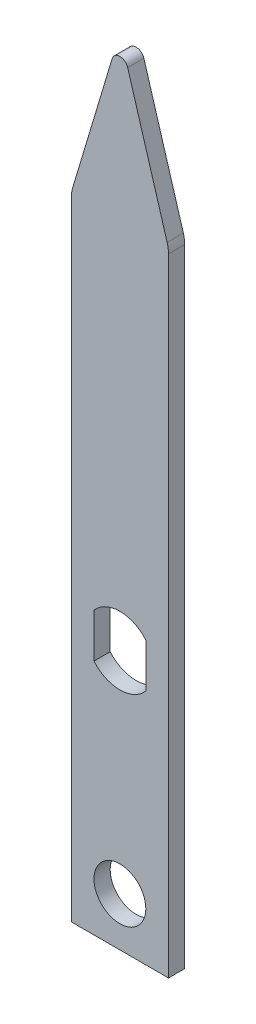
from build123d import *

# Parameters (mm, degrees)
EXTRUSION1_DEPTH = 5
EXTRUSION2_REACH = 247.51
ESQUISSE2_R      = 8
EXTRUSION3_REACH = 247.51
CONG_2_R         = 2.5
CONG_3_R         = 10


with BuildPart() as part:
    # Esquisse1 → Extrusion1 (new body)
    with BuildSketch(Plane.XY):
        Polygon((-15, 0), (-15, 195), (0, 245), (15, 195), (15, 0), align=None)
    extrude(amount=EXTRUSION1_DEPTH)

    # Esquisse2 → Extrusion2 (cut, up to next)
    with BuildSketch(Plane.XY.offset(5), mode=Mode.PRIVATE) as extrusion2_sk1:
        with Locations((0, 15)):
            Circle(ESQUISSE2_R)
    extrusion2_tool1 = extrude(extrusion2_sk1.sketch, amount=-EXTRUSION2_REACH, mode=Mode.PRIVATE) & part.part
    add(extrusion2_tool1.solids().sort_by_distance((0, 15, 5))[0], mode=Mode.SUBTRACT)

    # Esquisse3 → Extrusion3 (cut, up to next)
    with BuildSketch(Plane.XY.offset(5), mode=Mode.PRIVATE) as extrusion3_sk1:
        with BuildLine():
            Line((-8, 86.800735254), (-8, 73.199264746))
            ThreePointArc((-8, 73.199264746), (0, 69.5), (8, 73.199264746))
            Line((8, 73.199264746), (8, 86.800735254))
            ThreePointArc((8, 86.800735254), (0, 90.5), (-8, 86.800735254))
        make_face()
    extrusion3_tool1 = extrude(extrusion3_sk1.sketch, amount=-EXTRUSION3_REACH, mode=Mode.PRIVATE) & part.part
    add(extrusion3_tool1.solids().sort_by_distance((0, 80, 5))[0], mode=Mode.SUBTRACT)

    # Cong_2
    cong_2_edges = [part.edges().sort_by_distance(p)[0] for p in [
        (0, 245, 2.5),
    ]]
    fillet(cong_2_edges, radius=CONG_2_R)

    # Cong_3
    cong_3_edges = [part.edges().sort_by_distance(p)[0] for p in [
        (-15, 195, 2.5),
        (15, 195, 2.5),
    ]]
    fillet(cong_3_edges, radius=CONG_3_R)


solid = part.part
